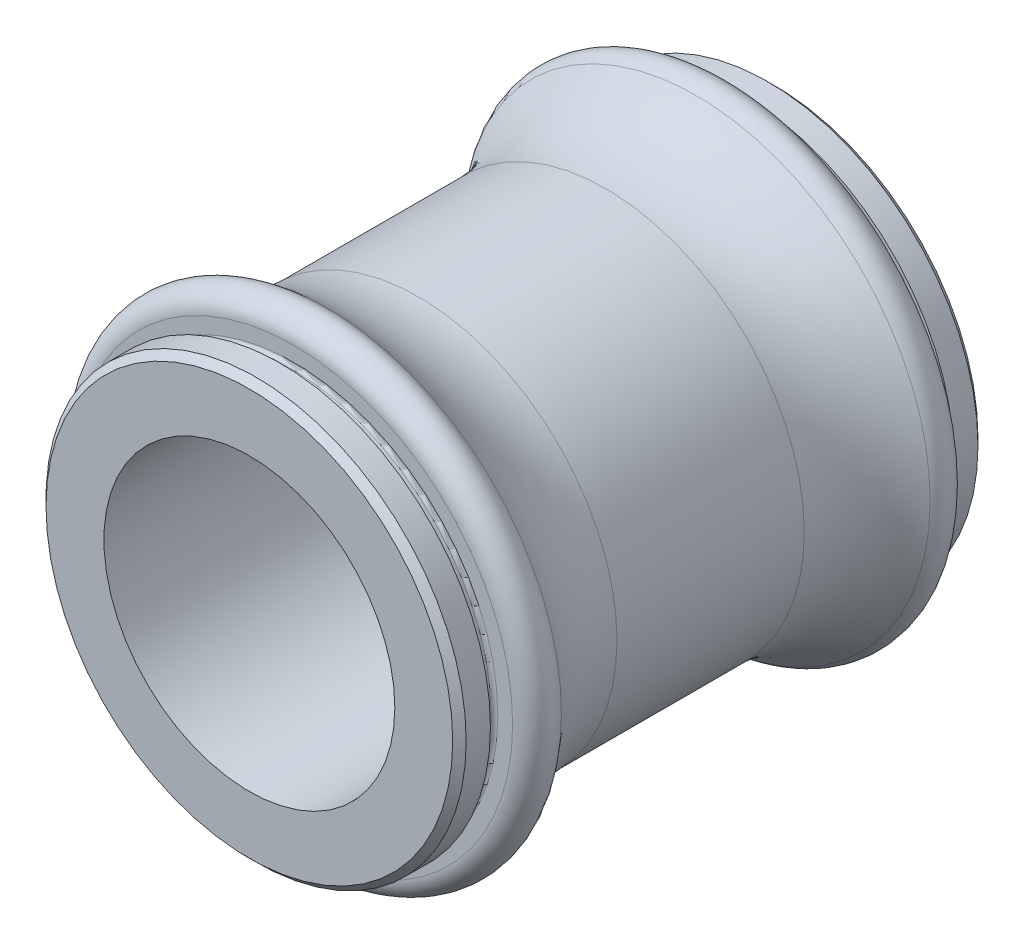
from build123d import *


with BuildPart() as part:
    # Sketch 1 → Revolve 1 (revolve)
    with BuildSketch(Plane(origin=(0, 0, 0), x_dir=(0, 0, -1), z_dir=(1, 0, 0)), mode=Mode.PRIVATE) as revolve_1_sk:
        with BuildLine():
            Line((-39, 10.8), (0, 10.8))
            Line((0, 10.8), (0, 15.1))
            Line((0, 15.1), (-0.5, 15.6))
            Line((-0.5, 15.6), (-2.3, 15.6))
            Line((-2.3, 15.6), (-2.3, 15.15))
            ThreePointArc((-2.3, 15.15), (-2.373223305, 14.973223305), (-2.55, 14.9))
            Line((-2.55, 14.9), (-3.05, 14.9))
            ThreePointArc((-3.05, 14.9), (-3.226776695, 14.973223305), (-3.3, 15.15))
            Line((-3.3, 15.15), (-3.3, 16.25))
            ThreePointArc((-3.3, 16.25), (-4.193994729, 17.622136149), (-5.810343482, 17.358695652))
            ThreePointArc((-5.810343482, 17.358695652), (-8.9343911, 15.424951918), (-12.545966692, 14.75))
            Line((-12.545966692, 14.75), (-26.454033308, 14.75))
            ThreePointArc((-26.454033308, 14.75), (-30.0656089, 15.424951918), (-33.189656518, 17.358695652))
            ThreePointArc((-33.189656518, 17.358695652), (-34.806005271, 17.622136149), (-35.7, 16.25))
            Line((-35.7, 16.25), (-35.7, 15.15))
            ThreePointArc((-35.7, 15.15), (-35.773223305, 14.973223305), (-35.95, 14.9))
            Line((-35.95, 14.9), (-36.45, 14.9))
            ThreePointArc((-36.45, 14.9), (-36.626776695, 14.973223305), (-36.7, 15.15))
            Line((-36.7, 15.15), (-36.7, 15.6))
            Line((-36.7, 15.6), (-38.5, 15.6))
            Line((-38.5, 15.6), (-39, 15.1))
            Line((-39, 15.1), (-39, 10.8))
        make_face()
    revolve(revolve_1_sk.sketch.rotate(Axis((0, 0, 0), (0, 0, 1)), 270), axis=Axis((0, 0, 0), (0, 0, 1)))


solid = part.part
